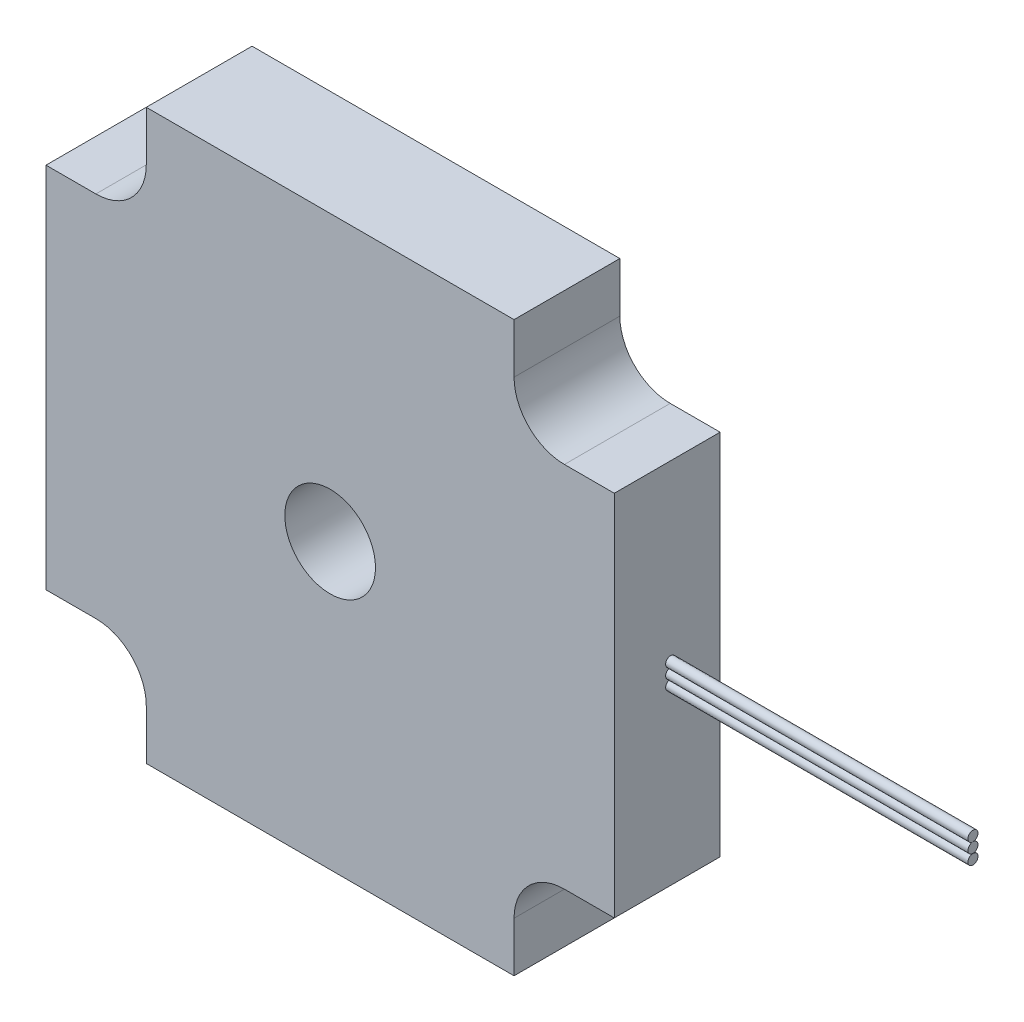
from build123d import *

# Parameters (mm, degrees)
EXTRUDE_1_DEPTH     = 10.5
SKETCH_3_R          = 4.5
CUT_EXTRUDE_1_DEPTH = 10.5
FILLET_1_R          = 5
SKETCH_4_R          = 0.5
EXTRUDE_2_DEPTH     = 30
EXTRUDE_2_2_DEPTH   = 30
EXTRUDE_2_3_DEPTH   = 30


with BuildPart() as part:
    # Sketch 2 → Extrude 1 (new body)
    with BuildSketch(Plane.XY):
        Polygon((-18.25, 18.25), (-28.2, 18.25), (-28.2, -18.25), (-18.25, -18.25), (-18.25, -28.2), (18.25, -28.2), (18.25, -18.25), (28.2, -18.25), (28.2, 18.25), (18.25, 18.25), (18.25, 28.2), (-18.25, 28.2), align=None)
    extrude(amount=EXTRUDE_1_DEPTH)

    # Sketch 3 → Cut-Extrude 1 (cut)
    with BuildSketch(Plane.XY.offset(10.5)):
        Circle(SKETCH_3_R)
    extrude(amount=-CUT_EXTRUDE_1_DEPTH, mode=Mode.SUBTRACT)

    # Fillet 1
    fillet_1_edges = [part.edges().sort_by_distance(p)[0] for p in [
        (-18.25, 18.25, 5.25),
        (18.25, 18.25, 5.25),
        (18.25, -18.25, 5.25),
        (-18.25, -18.25, 5.25),
    ]]
    fillet(fillet_1_edges, radius=FILLET_1_R)


with BuildPart() as body_2:
    # Sketch 4 → Extrude 2 (new body)
    with BuildSketch(Plane(origin=(28.2, 0, 0), x_dir=(0, 0, -1), z_dir=(1, 0, 0))):
        with Locations(Location((-4.906417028, 0, 0), (0, 0, 90))):
            Circle(SKETCH_4_R)
    extrude(amount=EXTRUDE_2_DEPTH)


with BuildPart() as body_3:
    # Sketch 4 → Extrude 2 2 (new body)
    with BuildSketch(Plane(origin=(28.2, 0, 0), x_dir=(0, 0, -1), z_dir=(1, 0, 0))):
        with Locations(Location((-4.906417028, 1, 0), (0, 0, 90))):
            Circle(SKETCH_4_R)
    extrude(amount=EXTRUDE_2_2_DEPTH)


with BuildPart() as body_4:
    # Sketch 4 → Extrude 2 3 (new body)
    with BuildSketch(Plane(origin=(28.2, 0, 0), x_dir=(0, 0, -1), z_dir=(1, 0, 0))):
        with Locations(Location((-4.906417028, -1, 0), (0, 0, 90))):
            Circle(SKETCH_4_R)
    extrude(amount=EXTRUDE_2_3_DEPTH)


solid = Compound([part.part, body_2.part, body_3.part, body_4.part])
